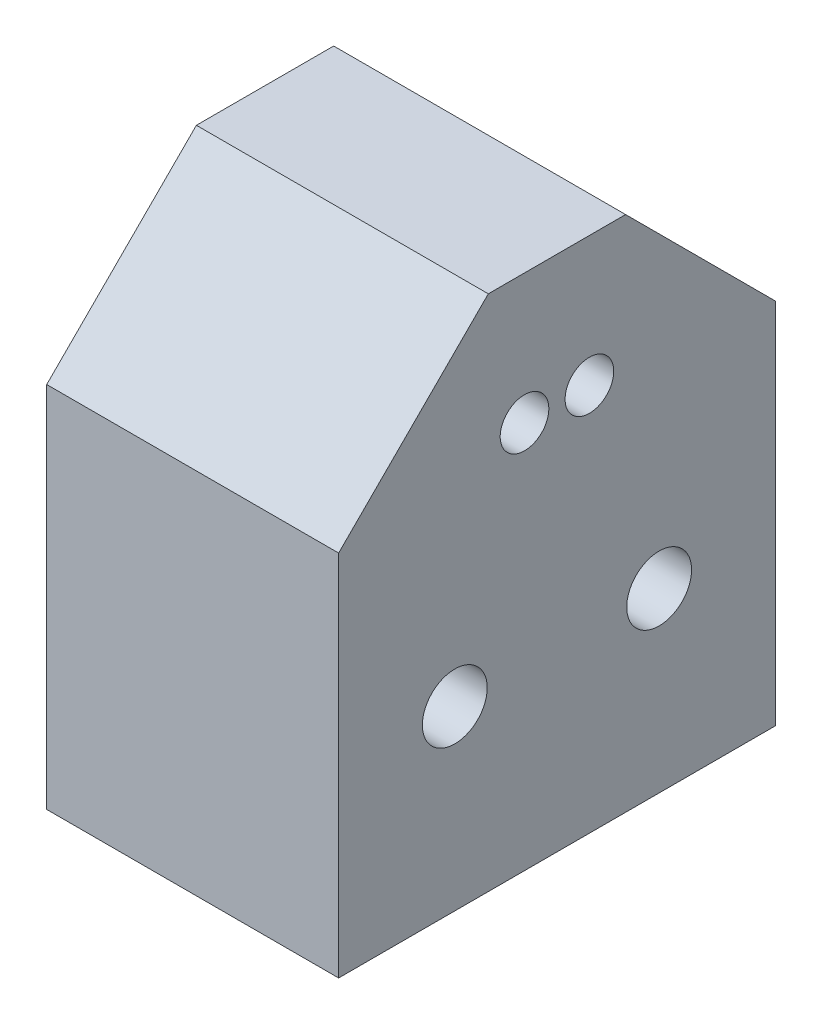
from build123d import *

# Parameters (mm, degrees)
BOSS_EXTRUDE1_DEPTH = 18
SKETCH2_R           = 2
SKETCH2_R_2         = 1.5
CUT_EXTRUDE2_DEPTH  = 53.087467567


with BuildPart() as part:
    # Sketch1 → Boss-Extrude1 (new body)
    with BuildSketch(Plane(origin=(0, 0, 0), x_dir=(0, 0, -1), z_dir=(1, 0, 0))):
        Polygon((-19.081516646, 35.771524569), (-9.853041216, 45), (-1.386641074, 45), (7.841834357, 35.771524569), (7.841834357, 13.079888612), (-19.081516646, 13.079888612), align=None)
    extrude(amount=BOSS_EXTRUDE1_DEPTH)

    # Sketch2 → Cut-Extrude2 (cut, through all)
    with BuildSketch(Plane(origin=(18, 0, 0), x_dir=(0, 0, -1), z_dir=(1, 0, 0))):
        with Locations((0.680158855, 24)):
            Circle(SKETCH2_R)
        with Locations((-7.619841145, 37)):
            Circle(SKETCH2_R_2)
        with Locations((-3.619841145, 37)):
            Circle(SKETCH2_R_2)
        with Locations((-11.919841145, 24)):
            Circle(SKETCH2_R)
    extrude(amount=-CUT_EXTRUDE2_DEPTH, mode=Mode.SUBTRACT)


solid = part.part
